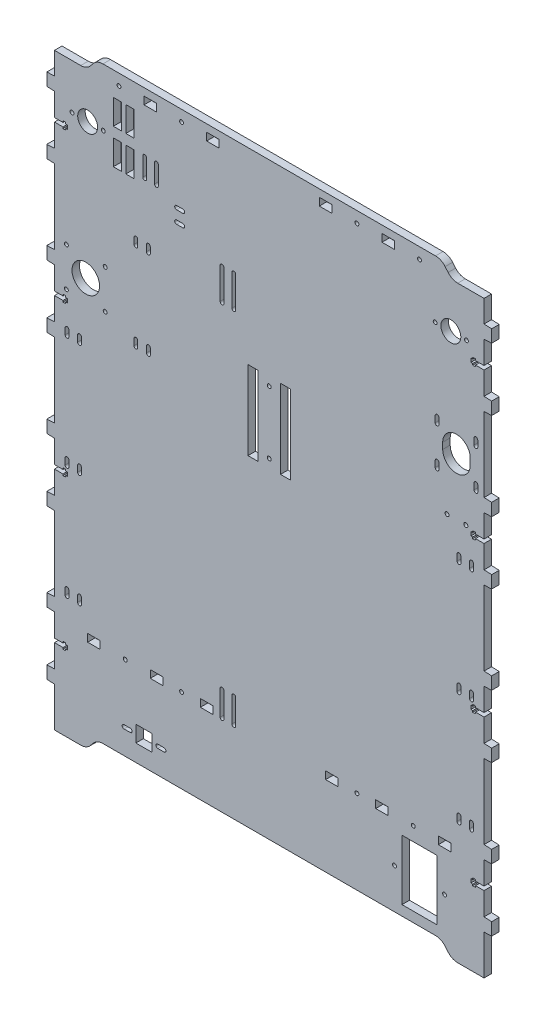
from build123d import *

# Parameters (mm, degrees)
SKETCH_1_R           = 1.55
SKETCH_1_R_2         = 7.95
SKETCH_1_W           = 10
SKETCH_1_H           = 6.1
SKETCH_1_W_2         = 6.4
SKETCH_1_H_2         = 20
SKETCH_1_W_3         = 8
SKETCH_1_H_3         = 63
EXTRUDE_1_DEPTH      = 6
SKETCH_3_R           = 1.55
SKETCH_3_W           = 28
SKETCH_3_H           = 48
CUT_EXTRUDE_2_DEPTH  = 512.837630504
CUT_EXTRUDE_3_DEPTH  = 512.837630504
SKETCH_5_R           = 11
SKETCH_5_R_2         = 1.55
CUT_EXTRUDE_4_DEPTH  = 512.837630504
CUT_EXTRUDE_5_DEPTH  = 512.837630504
CUT_EXTRUDE_7_DEPTH  = 512.837630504
SKETCH_9_W           = 13
SKETCH_9_H           = 13
CUT_EXTRUDE_8_DEPTH  = 512.837630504
CUT_EXTRUDE_9_DEPTH  = 512.837630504
CUT_EXTRUDE_10_DEPTH = 512.837630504
SKETCH_12_R          = 1.6
CUT_EXTRUDE_11_DEPTH = 512.837630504


with BuildPart() as part:
    # Sketch 1 → Extrude 1 (new body)
    with BuildSketch(Plane.XY):
        with BuildLine():
            Line((171.5, 92.25), (177.6, 92))
            Line((177.6, 92), (177.6, 82))
            Line((177.6, 82), (171.5, 81.75))
            Line((171.5, 81.75), (171.5, 63.55))
            Line((171.5, 63.55), (164.700039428, 63.55))
            Line((164.700039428, 63.55), (164.700039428, 64.75))
            Line((164.700039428, 64.75), (162.5, 64.75))
            Line((162.5, 64.75), (162.5, 63.55))
            Line((162.5, 63.55), (161, 63.55))
            Line((161, 63.55), (161, 60.45))
            Line((161, 60.45), (162.5, 60.45))
            Line((162.5, 60.45), (162.5, 59.25))
            Line((162.5, 59.25), (164.700039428, 59.25))
            Line((164.700039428, 59.25), (164.700039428, 60.45))
            Line((164.700039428, 60.45), (171.5, 60.45))
            Line((171.5, 60.45), (171.5, 42.25))
            Line((171.5, 42.25), (177.6, 42))
            Line((177.6, 42), (177.6, 32))
            Line((177.6, 32), (171.5, 31.75))
            Line((171.5, 31.75), (171.5, 0))
            Line((171.5, 0), (150.5, 0))
            ThreePointArc((150.5, 0), (146.273817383, 0.93692213), (142.839555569, 3.572123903))
            Line((142.839555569, 3.572123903), (140.443294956, 6.427876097))
            ThreePointArc((140.443294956, 6.427876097), (137.009033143, 9.06307787), (132.782850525, 10))
            Line((132.782850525, 10), (-132.782850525, 10))
            ThreePointArc((-132.782850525, 10), (-137.009033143, 9.06307787), (-140.443294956, 6.427876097))
            Line((-140.443294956, 6.427876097), (-142.839555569, 3.572123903))
            ThreePointArc((-142.839555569, 3.572123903), (-146.273817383, 0.93692213), (-150.5, 0))
            Line((-150.5, 0), (-171.5, 0))
            Line((-171.5, 0), (-171.5, 31.75))
            Line((-171.5, 31.75), (-177.6, 32))
            Line((-177.6, 32), (-177.6, 42))
            Line((-177.6, 42), (-171.5, 42.25))
            Line((-171.5, 42.25), (-171.5, 60.45))
            Line((-171.5, 60.45), (-164.700039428, 60.45))
            Line((-164.700039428, 60.45), (-164.700039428, 59.25))
            Line((-164.700039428, 59.25), (-162.5, 59.25))
            Line((-162.5, 59.25), (-162.5, 60.45))
            Line((-162.5, 60.45), (-161, 60.45))
            Line((-161, 60.45), (-161, 63.55))
            Line((-161, 63.55), (-162.5, 63.55))
            Line((-162.5, 63.55), (-162.5, 64.75))
            Line((-162.5, 64.75), (-164.700039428, 64.75))
            Line((-164.700039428, 64.75), (-164.700039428, 63.55))
            Line((-164.700039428, 63.55), (-171.5, 63.55))
            Line((-171.5, 63.55), (-171.5, 81.75))
            Line((-171.5, 81.75), (-177.6, 82))
            Line((-177.6, 82), (-177.6, 92))
            Line((-177.6, 92), (-171.5, 92.25))
            Line((-171.5, 92.25), (-171.5, 151.75))
            Line((-171.5, 151.75), (-177.6, 152))
            Line((-177.6, 152), (-177.6, 162))
            Line((-177.6, 162), (-171.5, 162.25))
            Line((-171.5, 162.25), (-171.5, 180.45))
            Line((-171.5, 180.45), (-164.700039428, 180.45))
            Line((-164.700039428, 180.45), (-164.700039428, 179.25))
            Line((-164.700039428, 179.25), (-162.5, 179.25))
            Line((-162.5, 179.25), (-162.5, 180.45))
            Line((-162.5, 180.45), (-161, 180.45))
            Line((-161, 180.45), (-161, 183.55))
            Line((-161, 183.55), (-162.5, 183.55))
            Line((-162.5, 183.55), (-162.5, 184.75))
            Line((-162.5, 184.75), (-164.700039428, 184.75))
            Line((-164.700039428, 184.75), (-164.700039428, 183.55))
            Line((-164.700039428, 183.55), (-171.5, 183.55))
            Line((-171.5, 183.55), (-171.5, 201.75))
            Line((-171.5, 201.75), (-177.6, 202))
            Line((-177.6, 202), (-177.6, 212))
            Line((-177.6, 212), (-171.5, 212.25))
            Line((-171.5, 212.25), (-171.5, 271.75))
            Line((-171.5, 271.75), (-177.6, 272))
            Line((-177.6, 272), (-177.6, 282))
            Line((-177.6, 282), (-171.5, 282.25))
            Line((-171.5, 282.25), (-171.5, 300.45))
            Line((-171.5, 300.45), (-164.700039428, 300.45))
            Line((-164.700039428, 300.45), (-164.700039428, 299.25))
            Line((-164.700039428, 299.25), (-162.5, 299.25))
            Line((-162.5, 299.25), (-162.5, 300.45))
            Line((-162.5, 300.45), (-161, 300.45))
            Line((-161, 300.45), (-161, 303.55))
            Line((-161, 303.55), (-162.5, 303.55))
            Line((-162.5, 303.55), (-162.5, 304.75))
            Line((-162.5, 304.75), (-164.700039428, 304.75))
            Line((-164.700039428, 304.75), (-164.700039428, 303.55))
            Line((-164.700039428, 303.55), (-171.5, 303.55))
            Line((-171.5, 303.55), (-171.5, 321.75))
            Line((-171.5, 321.75), (-177.6, 322))
            Line((-177.6, 322), (-177.6, 332))
            Line((-177.6, 332), (-171.5, 332.25))
            Line((-171.5, 332.25), (-171.5, 391.75))
            Line((-171.5, 391.75), (-177.6, 392))
            Line((-177.6, 392), (-177.6, 402))
            Line((-177.6, 402), (-171.5, 402.25))
            Line((-171.5, 402.25), (-171.5, 420.45))
            Line((-171.5, 420.45), (-164.700039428, 420.45))
            Line((-164.700039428, 420.45), (-164.700039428, 419.25))
            Line((-164.700039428, 419.25), (-162.5, 419.25))
            Line((-162.5, 419.25), (-162.5, 420.45))
            Line((-162.5, 420.45), (-161, 420.45))
            Line((-161, 420.45), (-161, 423.55))
            Line((-161, 423.55), (-162.5, 423.55))
            Line((-162.5, 423.55), (-162.5, 424.75))
            Line((-162.5, 424.75), (-164.700039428, 424.75))
            Line((-164.700039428, 424.75), (-164.700039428, 423.55))
            Line((-164.700039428, 423.55), (-171.5, 423.55))
            Line((-171.5, 423.55), (-171.5, 441.75))
            Line((-171.5, 441.75), (-177.6, 442))
            Line((-177.6, 442), (-177.6, 452))
            Line((-177.6, 452), (-171.5, 452.25))
            Line((-171.5, 452.25), (-171.5, 470))
            Line((-171.5, 470), (-150.5, 470))
            ThreePointArc((-150.5, 470), (-146.273817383, 470.93692213), (-142.839555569, 473.572123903))
            Line((-142.839555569, 473.572123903), (-140.443294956, 476.427876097))
            ThreePointArc((-140.443294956, 476.427876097), (-137.009033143, 479.06307787), (-132.782850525, 480))
            Line((-132.782850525, 480), (132.782850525, 480))
            ThreePointArc((132.782850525, 480), (137.009033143, 479.06307787), (140.443294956, 476.427876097))
            Line((140.443294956, 476.427876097), (142.839555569, 473.572123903))
            ThreePointArc((142.839555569, 473.572123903), (146.273817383, 470.93692213), (150.5, 470))
            Line((150.5, 470), (171.5, 470))
            Line((171.5, 470), (171.5, 452.25))
            Line((171.5, 452.25), (177.6, 452))
            Line((177.6, 452), (177.6, 442))
            Line((177.6, 442), (171.5, 441.75))
            Line((171.5, 441.75), (171.5, 423.55))
            Line((171.5, 423.55), (164.700039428, 423.55))
            Line((164.700039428, 423.55), (164.700039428, 424.75))
            Line((164.700039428, 424.75), (162.5, 424.75))
            Line((162.5, 424.75), (162.5, 423.55))
            Line((162.5, 423.55), (161, 423.55))
            Line((161, 423.55), (161, 420.45))
            Line((161, 420.45), (162.5, 420.45))
            Line((162.5, 420.45), (162.5, 419.25))
            Line((162.5, 419.25), (164.700039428, 419.25))
            Line((164.700039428, 419.25), (164.700039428, 420.45))
            Line((164.700039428, 420.45), (171.5, 420.45))
            Line((171.5, 420.45), (171.5, 402.25))
            Line((171.5, 402.25), (177.6, 402))
            Line((177.6, 402), (177.6, 392))
            Line((177.6, 392), (171.5, 391.75))
            Line((171.5, 391.75), (171.5, 332.25))
            Line((171.5, 332.25), (177.6, 332))
            Line((177.6, 332), (177.6, 322))
            Line((177.6, 322), (171.5, 321.75))
            Line((171.5, 321.75), (171.5, 303.55))
            Line((171.5, 303.55), (164.700039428, 303.55))
            Line((164.700039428, 303.55), (164.700039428, 304.75))
            Line((164.700039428, 304.75), (162.5, 304.75))
            Line((162.5, 304.75), (162.5, 303.55))
            Line((162.5, 303.55), (161, 303.55))
            Line((161, 303.55), (161, 300.45))
            Line((161, 300.45), (162.5, 300.45))
            Line((162.5, 300.45), (162.5, 299.25))
            Line((162.5, 299.25), (164.700039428, 299.25))
            Line((164.700039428, 299.25), (164.700039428, 300.45))
            Line((164.700039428, 300.45), (171.5, 300.45))
            Line((171.5, 300.45), (171.5, 282.25))
            Line((171.5, 282.25), (177.6, 282))
            Line((177.6, 282), (177.6, 272))
            Line((177.6, 272), (171.5, 271.75))
            Line((171.5, 271.75), (171.5, 212.25))
            Line((171.5, 212.25), (177.6, 212))
            Line((177.6, 212), (177.6, 202))
            Line((177.6, 202), (171.5, 201.75))
            Line((171.5, 201.75), (171.5, 183.55))
            Line((171.5, 183.55), (164.700039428, 183.55))
            Line((164.700039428, 183.55), (164.700039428, 184.75))
            Line((164.700039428, 184.75), (162.5, 184.75))
            Line((162.5, 184.75), (162.5, 183.55))
            Line((162.5, 183.55), (161, 183.55))
            Line((161, 183.55), (161, 180.45))
            Line((161, 180.45), (162.5, 180.45))
            Line((162.5, 180.45), (162.5, 179.25))
            Line((162.5, 179.25), (164.700039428, 179.25))
            Line((164.700039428, 179.25), (164.700039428, 180.45))
            Line((164.700039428, 180.45), (171.5, 180.45))
            Line((171.5, 180.45), (171.5, 162.25))
            Line((171.5, 162.25), (177.6, 162))
            Line((177.6, 162), (177.6, 152))
            Line((177.6, 152), (171.5, 151.75))
            Line((171.5, 151.75), (171.5, 92.25))
        make_face()
        with Locations((0, 273.5)):
            Circle(SKETCH_1_R, mode=Mode.SUBTRACT)
        with Locations(Location((132.5, 434, 0), (0, 0, 180))):
            Circle(SKETCH_1_R, mode=Mode.SUBTRACT)
        with Locations(Location((145, 434, 0), (0, 0, 180))):
            Circle(SKETCH_1_R_2, mode=Mode.SUBTRACT)
        with Locations(Location((115, 77, 0), (0, 0, 180))):
            Circle(SKETCH_1_R, mode=Mode.SUBTRACT)
        with Locations(Location((70, 471.1, 0), (0, 0, 180))):
            Circle(SKETCH_1_R, mode=Mode.SUBTRACT)
        with Locations((-70, 77)):
            Circle(SKETCH_1_R, mode=Mode.SUBTRACT)
        with Locations((-115, 77)):
            Circle(SKETCH_1_R, mode=Mode.SUBTRACT)
        with Locations(Location((120, 471.1, 0), (0, 0, 180))):
            Circle(SKETCH_1_R, mode=Mode.SUBTRACT)
        with Locations(Location((70, 77, 0), (0, 0, 180))):
            Circle(SKETCH_1_R, mode=Mode.SUBTRACT)
        with Locations(Location((157.5, 434, 0), (0, 0, 180))):
            Circle(SKETCH_1_R, mode=Mode.SUBTRACT)
        with Locations((-70, 471.1)):
            Circle(SKETCH_1_R, mode=Mode.SUBTRACT)
        with Locations((-132.5, 434)):
            Circle(SKETCH_1_R, mode=Mode.SUBTRACT)
        with Locations((-120, 471.1)):
            Circle(SKETCH_1_R, mode=Mode.SUBTRACT)
        with Locations((-157.5, 434)):
            Circle(SKETCH_1_R, mode=Mode.SUBTRACT)
        with Locations(Location((0, 323.5, 0), (0, 0, 180))):
            Circle(SKETCH_1_R, mode=Mode.SUBTRACT)
        with Locations((-145, 434)):
            Circle(SKETCH_1_R_2, mode=Mode.SUBTRACT)
        with Locations((90, 77)):
            Rectangle(SKETCH_1_W, SKETCH_1_H, mode=Mode.SUBTRACT)
        with Locations((140, 77)):
            Rectangle(SKETCH_1_W, SKETCH_1_H, mode=Mode.SUBTRACT)
        with Locations((95, 471.1)):
            Rectangle(SKETCH_1_W, SKETCH_1_H, mode=Mode.SUBTRACT)
        with Locations((45, 471.1)):
            Rectangle(SKETCH_1_W, SKETCH_1_H, mode=Mode.SUBTRACT)
        with Locations((50, 77)):
            Rectangle(SKETCH_1_W, SKETCH_1_H, mode=Mode.SUBTRACT)
        with Locations((-50, 77)):
            Rectangle(SKETCH_1_W, SKETCH_1_H, mode=Mode.SUBTRACT)
        with Locations((-90, 77)):
            Rectangle(SKETCH_1_W, SKETCH_1_H, mode=Mode.SUBTRACT)
        with Locations((-140, 77)):
            Rectangle(SKETCH_1_W, SKETCH_1_H, mode=Mode.SUBTRACT)
        with Locations((-45, 471.1)):
            Rectangle(SKETCH_1_W, SKETCH_1_H, mode=Mode.SUBTRACT)
        with Locations((-95, 471.1)):
            Rectangle(SKETCH_1_W, SKETCH_1_H, mode=Mode.SUBTRACT)
        with Locations((-111.3, 451)):
            Rectangle(SKETCH_1_W_2, SKETCH_1_H_2, mode=Mode.SUBTRACT)
        with Locations((-121.3, 451)):
            Rectangle(SKETCH_1_W_2, SKETCH_1_H_2, mode=Mode.SUBTRACT)
        with Locations((-121.3, 423)):
            Rectangle(SKETCH_1_W_2, SKETCH_1_H_2, mode=Mode.SUBTRACT)
        with Locations((-111.3, 423)):
            Rectangle(SKETCH_1_W_2, SKETCH_1_H_2, mode=Mode.SUBTRACT)
        with Locations((-13, 298.5)):
            Rectangle(SKETCH_1_W_3, SKETCH_1_H_3, mode=Mode.SUBTRACT)
        with Locations((13, 298.5)):
            Rectangle(SKETCH_1_W_3, SKETCH_1_H_3, mode=Mode.SUBTRACT)
    extrude(amount=-EXTRUDE_1_DEPTH)

    # Sketch 3 → Cut-Extrude 2 (cut, through all)
    with BuildSketch(Plane.XY):
        with Locations((140, 42)):
            Circle(SKETCH_3_R)
        with Locations(Location((100, 42, 0), (0, 0, 180))):
            Circle(SKETCH_3_R)
        with Locations((120, 42)):
            Rectangle(SKETCH_3_W, SKETCH_3_H)
    extrude(amount=-CUT_EXTRUDE_2_DEPTH, mode=Mode.SUBTRACT)

    # Sketch 4 → Cut-Extrude 3 (cut, through all)
    with BuildSketch(Plane.XY):
        with BuildLine():
            Line((138.5, 349), (138.5, 354))
            ThreePointArc((138.5, 354), (149.5, 365), (160.5, 354))
            Line((160.5, 354), (160.5, 349))
            ThreePointArc((160.5, 349), (149.5, 338), (138.5, 349))
        make_face()
        with BuildLine():
            Line((132.5, 364.5), (132.5, 369.5))
            ThreePointArc((132.5, 369.5), (134, 371), (135.5, 369.5))
            Line((135.5, 369.5), (135.5, 364.5))
            ThreePointArc((135.5, 364.5), (134, 363), (132.5, 364.5))
        make_face()
        with BuildLine():
            Line((163.5, 364.5), (163.5, 369.5))
            ThreePointArc((163.5, 369.5), (165, 371), (166.5, 369.5))
            Line((166.5, 369.5), (166.5, 364.5))
            ThreePointArc((166.5, 364.5), (165, 363), (163.5, 364.5))
        make_face()
        with BuildLine():
            Line((135.5, 338.5), (135.5, 333.5))
            ThreePointArc((135.5, 333.5), (134, 332), (132.5, 333.5))
            Line((132.5, 333.5), (132.5, 338.5))
            ThreePointArc((132.5, 338.5), (134, 340), (135.5, 338.5))
        make_face()
        with BuildLine():
            Line((166.5, 338.5), (166.5, 333.5))
            ThreePointArc((166.5, 333.5), (165, 332), (163.5, 333.5))
            Line((163.5, 333.5), (163.5, 338.5))
            ThreePointArc((163.5, 338.5), (165, 340), (166.5, 338.5))
        make_face()
    extrude(amount=-CUT_EXTRUDE_3_DEPTH, mode=Mode.SUBTRACT)

    # Sketch 5 → Cut-Extrude 4 (cut, through all)
    with BuildSketch(Plane.XY):
        with Locations((-146.5, 325)):
            Circle(SKETCH_5_R)
        with Locations((-162, 340.5)):
            Circle(SKETCH_5_R_2)
        with Locations((-131, 340.5)):
            Circle(SKETCH_5_R_2)
        with Locations((-131, 309.5)):
            Circle(SKETCH_5_R_2)
        with Locations((-162, 309.5)):
            Circle(SKETCH_5_R_2)
    extrude(amount=-CUT_EXTRUDE_4_DEPTH, mode=Mode.SUBTRACT)

    # Sketch 6 → Cut-Extrude 5 (cut, through all)
    with BuildSketch(Plane.XY):
        with BuildLine():
            Line((-160, 282.5), (-160, 277.5))
            ThreePointArc((-160, 277.5), (-161.5, 276), (-163, 277.5))
            Line((-163, 277.5), (-163, 282.5))
            ThreePointArc((-163, 282.5), (-161.5, 284), (-160, 282.5))
        make_face()
        with BuildLine():
            Line((-153, 282.5), (-153, 277.5))
            ThreePointArc((-153, 277.5), (-151.5, 276), (-150, 277.5))
            Line((-150, 277.5), (-150, 282.5))
            ThreePointArc((-150, 282.5), (-151.5, 284), (-153, 282.5))
        make_face()
        with BuildLine():
            Line((-160, 192.5), (-160, 187.5))
            ThreePointArc((-160, 187.5), (-161.5, 186), (-163, 187.5))
            Line((-163, 187.5), (-163, 192.5))
            ThreePointArc((-163, 192.5), (-161.5, 194), (-160, 192.5))
        make_face()
        with BuildLine():
            Line((-153, 192.5), (-153, 187.5))
            ThreePointArc((-153, 187.5), (-151.5, 186), (-150, 187.5))
            Line((-150, 187.5), (-150, 192.5))
            ThreePointArc((-150, 192.5), (-151.5, 194), (-153, 192.5))
        make_face()
        with BuildLine():
            Line((-160, 102.5), (-160, 97.5))
            ThreePointArc((-160, 97.5), (-161.5, 96), (-163, 97.5))
            Line((-163, 97.5), (-163, 102.5))
            ThreePointArc((-163, 102.5), (-161.5, 104), (-160, 102.5))
        make_face()
        with BuildLine():
            Line((-153, 102.5), (-153, 97.5))
            ThreePointArc((-153, 97.5), (-151.5, 96), (-150, 97.5))
            Line((-150, 97.5), (-150, 102.5))
            ThreePointArc((-150, 102.5), (-151.5, 104), (-153, 102.5))
        make_face()
        with BuildLine():
            Line((-105, 302.5), (-105, 297.5))
            ThreePointArc((-105, 297.5), (-106.5, 296), (-108, 297.5))
            Line((-108, 297.5), (-108, 302.5))
            ThreePointArc((-108, 302.5), (-106.5, 304), (-105, 302.5))
        make_face()
        with BuildLine():
            Line((-98, 302.5), (-98, 297.5))
            ThreePointArc((-98, 297.5), (-96.5, 296), (-95, 297.5))
            Line((-95, 297.5), (-95, 302.5))
            ThreePointArc((-95, 302.5), (-96.5, 304), (-98, 302.5))
        make_face()
        with BuildLine():
            Line((-105, 372.5), (-105, 367.5))
            ThreePointArc((-105, 367.5), (-106.5, 366), (-108, 367.5))
            Line((-108, 367.5), (-108, 372.5))
            ThreePointArc((-108, 372.5), (-106.5, 374), (-105, 372.5))
        make_face()
        with BuildLine():
            Line((153, 102.5), (153, 97.5))
            ThreePointArc((153, 97.5), (151.5, 96), (150, 97.5))
            Line((150, 97.5), (150, 102.5))
            ThreePointArc((150, 102.5), (151.5, 104), (153, 102.5))
        make_face()
        with BuildLine():
            Line((160, 102.5), (160, 97.5))
            ThreePointArc((160, 97.5), (161.5, 96), (163, 97.5))
            Line((163, 97.5), (163, 102.5))
            ThreePointArc((163, 102.5), (161.5, 104), (160, 102.5))
        make_face()
        with BuildLine():
            Line((153, 192.5), (153, 187.5))
            ThreePointArc((153, 187.5), (151.5, 186), (150, 187.5))
            Line((150, 187.5), (150, 192.5))
            ThreePointArc((150, 192.5), (151.5, 194), (153, 192.5))
        make_face()
        with BuildLine():
            Line((160, 192.5), (160, 187.5))
            ThreePointArc((160, 187.5), (161.5, 186), (163, 187.5))
            Line((163, 187.5), (163, 192.5))
            ThreePointArc((163, 192.5), (161.5, 194), (160, 192.5))
        make_face()
        with BuildLine():
            Line((153, 282.5), (153, 277.5))
            ThreePointArc((153, 277.5), (151.5, 276), (150, 277.5))
            Line((150, 277.5), (150, 282.5))
            ThreePointArc((150, 282.5), (151.5, 284), (153, 282.5))
        make_face()
        with BuildLine():
            Line((160, 282.5), (160, 277.5))
            ThreePointArc((160, 277.5), (161.5, 276), (163, 277.5))
            Line((163, 277.5), (163, 282.5))
            ThreePointArc((163, 282.5), (161.5, 284), (160, 282.5))
        make_face()
        with BuildLine():
            Line((-98, 372.5), (-98, 367.5))
            ThreePointArc((-98, 367.5), (-96.5, 366), (-95, 367.5))
            Line((-95, 367.5), (-95, 372.5))
            ThreePointArc((-95, 372.5), (-96.5, 374), (-98, 372.5))
        make_face()
    extrude(amount=-CUT_EXTRUDE_5_DEPTH, mode=Mode.SUBTRACT)

    # Sketch 8 → Cut-Extrude 7 (cut, through all)
    with BuildSketch(Plane.XY):
        with BuildLine():
            Line((-36.2, 95), (-36.2, 75))
            ThreePointArc((-36.2, 75), (-37.7, 73.5), (-39.2, 75))
            Line((-39.2, 75), (-39.2, 95))
            ThreePointArc((-39.2, 95), (-37.7, 96.5), (-36.2, 95))
        make_face()
        with BuildLine():
            Line((-29.8, 95), (-29.8, 75))
            ThreePointArc((-29.8, 75), (-28.3, 73.5), (-26.8, 75))
            Line((-26.8, 75), (-26.8, 95))
            ThreePointArc((-26.8, 95), (-28.3, 96.5), (-29.8, 95))
        make_face()
        with BuildLine():
            Line((-36.2, 387.5), (-36.2, 362.5))
            ThreePointArc((-36.2, 362.5), (-37.7, 361), (-39.2, 362.5))
            Line((-39.2, 362.5), (-39.2, 387.5))
            ThreePointArc((-39.2, 387.5), (-37.7, 389), (-36.2, 387.5))
        make_face()
        with BuildLine():
            Line((-29.8, 387.5), (-29.8, 362.5))
            ThreePointArc((-29.8, 362.5), (-28.3, 361), (-26.8, 362.5))
            Line((-26.8, 362.5), (-26.8, 387.5))
            ThreePointArc((-26.8, 387.5), (-28.3, 389), (-29.8, 387.5))
        make_face()
    extrude(amount=-CUT_EXTRUDE_7_DEPTH, mode=Mode.SUBTRACT)

    # Sketch 9 → Cut-Extrude 8 (cut, through all)
    with BuildSketch(Plane.XY):
        with Locations((-100, 30)):
            Rectangle(SKETCH_9_W, SKETCH_9_H)
        with BuildLine():
            Line((-89, 31.5), (-84, 31.5))
            ThreePointArc((-84, 31.5), (-82.5, 30), (-84, 28.5))
            Line((-84, 28.5), (-89, 28.5))
            ThreePointArc((-89, 28.5), (-90.5, 30), (-89, 31.5))
        make_face()
        with BuildLine():
            Line((-111, 31.5), (-116, 31.5))
            ThreePointArc((-116, 31.5), (-117.5, 30), (-116, 28.5))
            Line((-116, 28.5), (-111, 28.5))
            ThreePointArc((-111, 28.5), (-109.5, 30), (-111, 31.5))
        make_face()
    extrude(amount=-CUT_EXTRUDE_8_DEPTH, mode=Mode.SUBTRACT)

    # Sketch 10 → Cut-Extrude 9 (cut, through all)
    with BuildSketch(Plane(origin=(0, 0, -6), x_dir=(-1, 0, 0), z_dir=(0, 0, -1))):
        with BuildLine():
            Line((91.6, 432.5), (91.6, 417.5))
            ThreePointArc((91.6, 417.5), (90.1, 416), (88.6, 417.5))
            Line((88.6, 417.5), (88.6, 432.5))
            ThreePointArc((88.6, 432.5), (90.1, 434), (91.6, 432.5))
        make_face()
        with BuildLine():
            Line((101, 432.5), (101, 417.5))
            ThreePointArc((101, 417.5), (99.5, 416), (98, 417.5))
            Line((98, 417.5), (98, 432.5))
            ThreePointArc((98, 432.5), (99.5, 434), (101, 432.5))
        make_face()
    extrude(amount=-CUT_EXTRUDE_9_DEPTH, mode=Mode.SUBTRACT)

    # Sketch 11 → Cut-Extrude 10 (cut, through all)
    with BuildSketch(Plane(origin=(0, 0, -6), x_dir=(-1, 0, 0), z_dir=(0, 0, -1))):
        with BuildLine():
            Line((69, 401.5), (74, 401.5))
            ThreePointArc((74, 401.5), (75.5, 400), (74, 398.5))
            Line((74, 398.5), (69, 398.5))
            ThreePointArc((69, 398.5), (67.5, 400), (69, 401.5))
        make_face()
        with BuildLine():
            Line((69, 411.5), (74, 411.5))
            ThreePointArc((74, 411.5), (75.5, 410), (74, 408.5))
            Line((74, 408.5), (69, 408.5))
            ThreePointArc((69, 408.5), (67.5, 410), (69, 411.5))
        make_face()
    extrude(amount=-CUT_EXTRUDE_10_DEPTH, mode=Mode.SUBTRACT)

    # Sketch 12 → Cut-Extrude 11 (cut, through all)
    with BuildSketch(Plane(origin=(0, 0, -6), x_dir=(-1, 0, 0), z_dir=(0, 0, -1))):
        with Locations((-142, 306)):
            Circle(SKETCH_12_R)
        with Locations(Location((-157, 306, 0), (0, 0, 180))):
            Circle(SKETCH_12_R)
    extrude(amount=-CUT_EXTRUDE_11_DEPTH, mode=Mode.SUBTRACT)


solid = part.part
